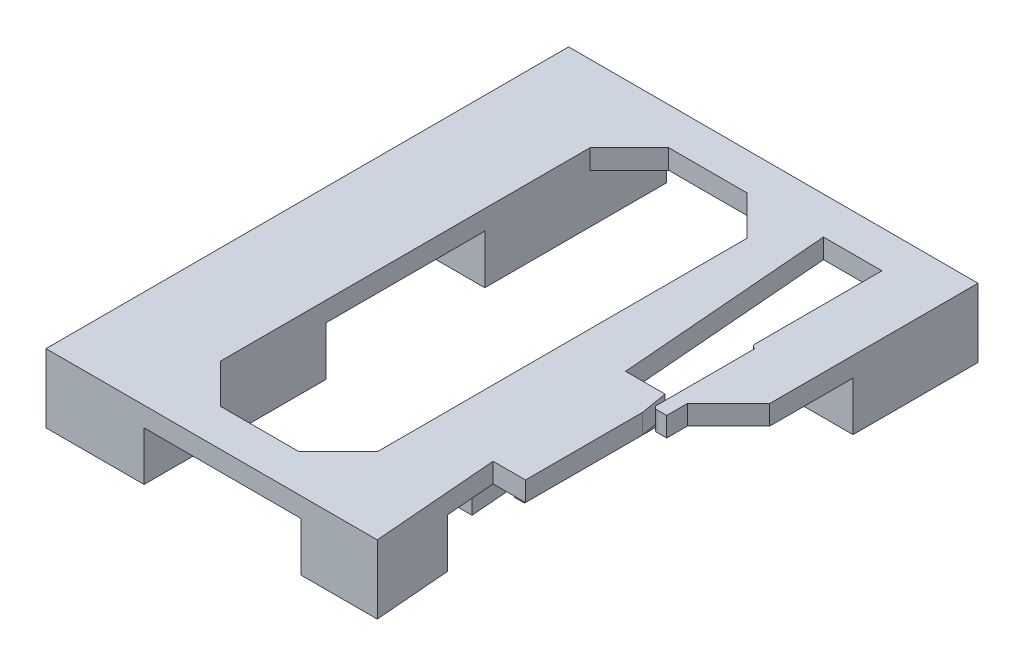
from build123d import *

# Parameters (mm, degrees)
BOSS_EXTRUDE1_DEPTH = 2
SKETCH12_W          = 10
SKETCH12_H          = 18.55
BOSS_EXTRUDE2_DEPTH = 5
SKETCH13_W          = 1
SKETCH13_H          = 14
BOSS_EXTRUDE3_DEPTH = 0.4
SKETCH14_W          = 6
SKETCH14_H          = 12.75
BOSS_EXTRUDE4_DEPTH = 5


with BuildPart() as part:
    # Sketch11 → Boss-Extrude1 (new body)
    with BuildSketch(Plane(origin=(0, 0, 0), x_dir=(1, 0, 0), z_dir=(0, 1, 0))):
        with BuildLine():
            Line((43.65, 1.2), (47.85, 5.4))
            Line((47.85, 5.4), (47.85, 26.65))
            Line((47.85, 26.65), (6.1, 26.65))
            Line((6.1, 26.65), (6.1, -26.65))
            Line((6.1, -26.65), (39.882910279, -26.65))
            Line((39.882910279, -26.65), (38.846785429, -13.8))
            Line((38.846785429, -13.8), (42.15, -13.8))
            Line((42.15, -13.8), (42.15, -1.873333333))
            Line((42.15, -1.873333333), (41.68258427, 0.9))
            Line((41.68258427, 0.9), (37.661490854, 0.9))
            Line((37.661490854, 0.9), (35.89161222, 22.85))
            Line((35.89161222, 22.85), (41.85, 22.85))
            Line((41.85, 22.85), (41.85, 9.9))
            ThreePointArc((41.85, 9.9), (41.967157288, 9.617157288), (42.25, 9.5))
            Line((42.25, 9.5), (42.25, 8.3))
            Line((42.25, 8.3), (42.25, -0.5))
            ThreePointArc((42.25, -0.5), (42.367157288, -0.782842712), (42.65, -0.9))
            Line((42.65, -0.9), (43.65, -0.9))
            Line((43.65, -0.9), (43.65, 1.2))
        make_face()
        Polygon((32.1, -18.85), (28.1, -22.85), (20.1, -22.85), (16.1, -18.85), (16.1, 18.85), (20.1, 22.85), (28.1, 22.85), (32.1, 18.85), align=None, mode=Mode.SUBTRACT)
    extrude(amount=BOSS_EXTRUDE1_DEPTH)

    # Sketch12 → Boss-Extrude2 (add)
    with BuildSketch(Plane(origin=(0, 0, 0), x_dir=(1, 0, 0), z_dir=(0, 1, 0))):
        with Locations((11.1, 17.375)):
            Rectangle(SKETCH12_W, SKETCH12_H)
        Polygon((32.1, -8.2), (35.189695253, -8.2), (35.548508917, -12.65), (32.1, -12.65), align=None)
        with Locations((11.1, -17.375)):
            Rectangle(SKETCH12_W, SKETCH12_H)
        Polygon((39.253978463, -18.85), (32.1, -18.85), (32.1, -26.65), (39.882910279, -26.65), align=None)
    extrude(amount=-BOSS_EXTRUDE2_DEPTH)

    # Sketch13 → Boss-Extrude3 (add)
    with BuildSketch(Plane(origin=(0, 0, 0), x_dir=(1, 0, 0), z_dir=(0, 1, 0))):
        with Locations((42.75, 6.5)):
            Rectangle(SKETCH13_W, SKETCH13_H)
        with Locations((41.25, -6.5)):
            Rectangle(SKETCH13_W, SKETCH13_H)
    extrude(amount=-BOSS_EXTRUDE3_DEPTH)

    # Sketch14 → Boss-Extrude4 (add)
    with BuildSketch(Plane(origin=(0, 0, 0), x_dir=(1, 0, 0), z_dir=(0, 1, 0))):
        with Locations((44.85, 20.275)):
            Rectangle(SKETCH14_W, SKETCH14_H)
    extrude(amount=-BOSS_EXTRUDE4_DEPTH)


solid = part.part
